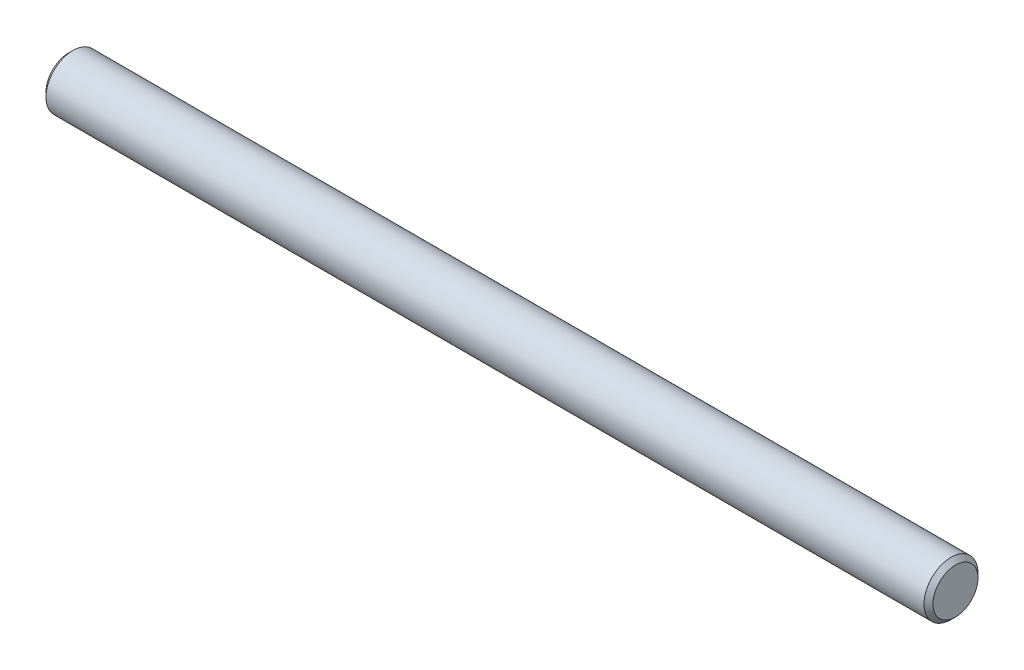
from build123d import *

# Parameters (mm, degrees)
SKETCH1_R      = 6
EXTRUDE1_DEPTH = 197
CHAMFER1_SIZE  = 1


with BuildPart() as part:
    # Sketch1 → Extrude1 (new body)
    with BuildSketch(Plane(origin=(0, 0, 0), x_dir=(0, 0, -1), z_dir=(1, 0, 0))):
        Circle(SKETCH1_R)
    extrude(amount=EXTRUDE1_DEPTH)

    # Chamfer1
    chamfer1_edges = [part.edges().sort_by_distance(p)[0] for p in [
        (0, 0, 6),
        (197, 0, 6),
    ]]
    chamfer(chamfer1_edges, length=CHAMFER1_SIZE)


solid = part.part
